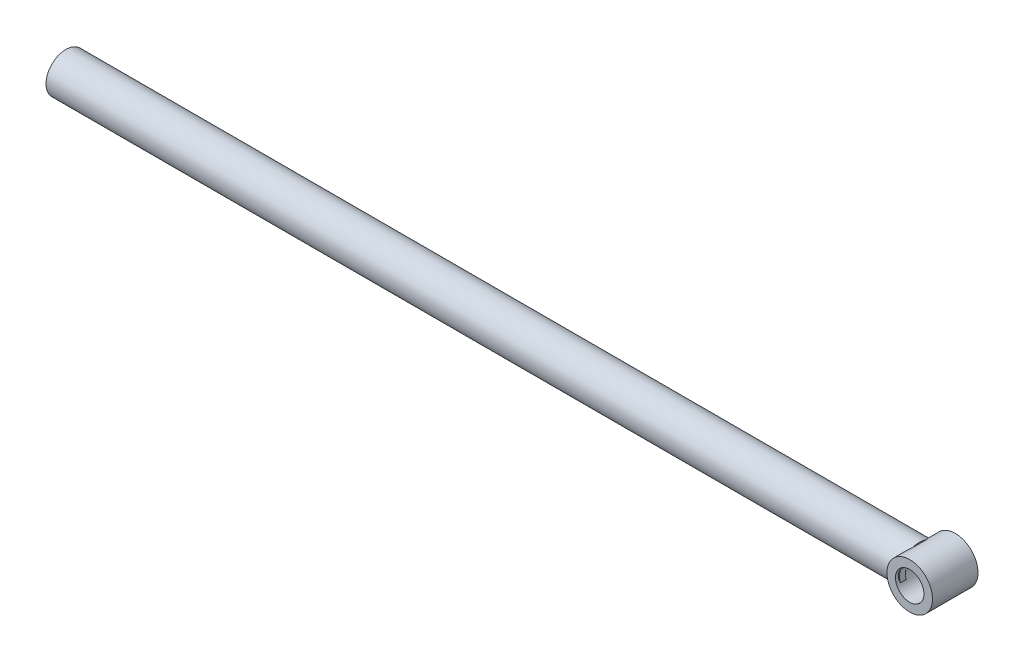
from build123d import *

# Parameters (mm, degrees)
ESQUISSE1_R      = 8
ESQUISSE1_R_2    = 5
EXTRUSION1_DEPTH = 16
ESQUISSE3_W      = 300
ESQUISSE3_H      = 2


with BuildPart() as part:
    # Esquisse1 → Extrusion1 (new body)
    with BuildSketch(Plane.XY):
        with Locations((282.839330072, 0)):
            Circle(ESQUISSE1_R)
        with Locations((282.839330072, 0)):
            Circle(ESQUISSE1_R_2, mode=Mode.SUBTRACT)
    extrude(amount=EXTRUSION1_DEPTH)

    # Esquisse3 → R_volution3 (revolve)
    with BuildSketch(Plane(origin=(0, 0, 0), x_dir=(1, 0, 0), z_dir=(0, 1, 0)), mode=Mode.PRIVATE) as r_volution3_sk:
        with Locations((128.267706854, -2)):
            Rectangle(ESQUISSE3_W, ESQUISSE3_H)
    revolve(r_volution3_sk.sketch.rotate(Axis((-116.634609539, 0, 8), (1, 0, 0)), 180), axis=Axis((-116.634609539, 0, 8), (1, 0, 0)))


solid = part.part
